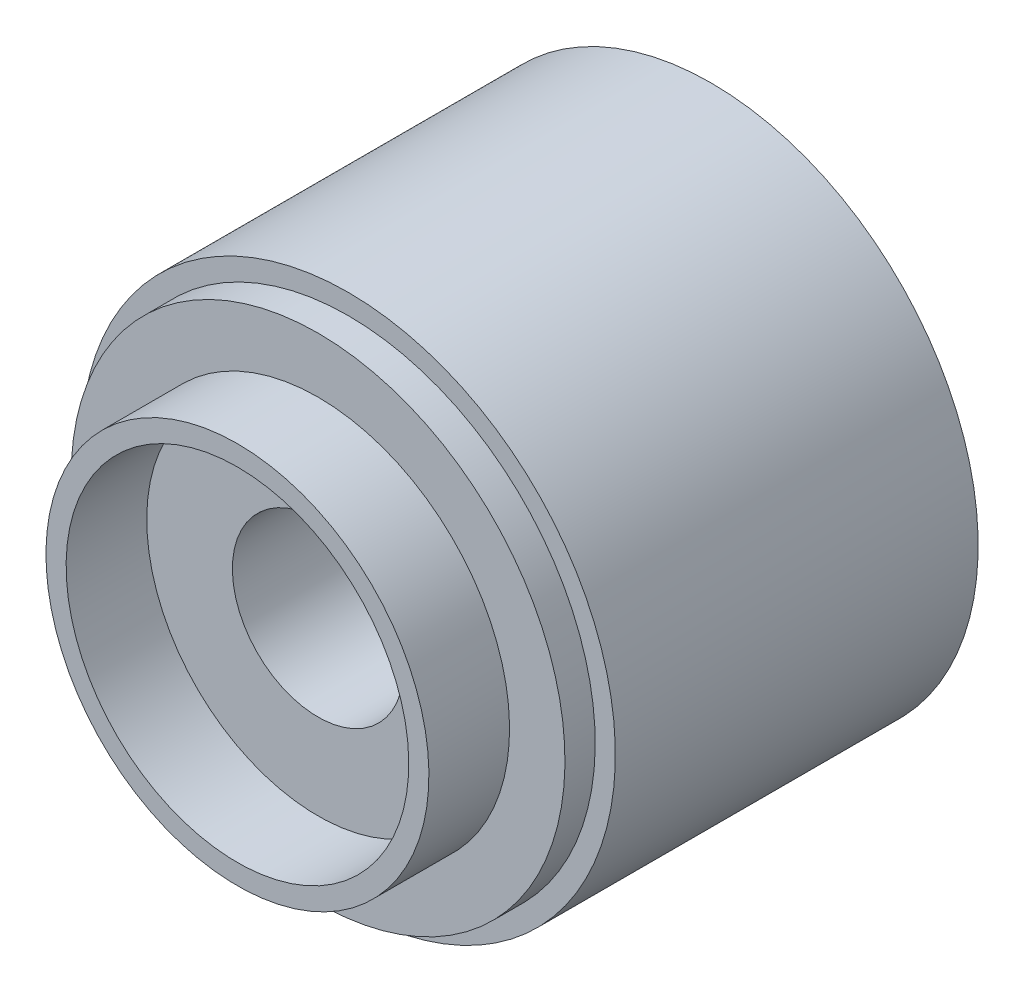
ISO-10303-21;
HEADER;
FILE_DESCRIPTION(('STEP AP214'),'2;1');
FILE_NAME('part.step','',(''),(''),'','','');
FILE_SCHEMA(('AUTOMOTIVE_DESIGN { 1 0 10303 214 1 1 1 1 }'));
ENDSEC;
DATA;
#1=APPLICATION_CONTEXT('core data for automotive mechanical design processes');
#2=APPLICATION_PROTOCOL_DEFINITION('international standard','automotive_design',2000,#1);
#3=PRODUCT_CONTEXT('',#1,'mechanical');
#4=PRODUCT('Part','Part','',(#3));
#5=PRODUCT_RELATED_PRODUCT_CATEGORY('part','',(#4));
#6=PRODUCT_DEFINITION_FORMATION('','',#4);
#7=PRODUCT_DEFINITION_CONTEXT('part definition',#1,'design');
#8=PRODUCT_DEFINITION('design','',#6,#7);
#9=PRODUCT_DEFINITION_SHAPE('','',#8);
#10=(LENGTH_UNIT() NAMED_UNIT(*) SI_UNIT(.MILLI.,.METRE.));
#11=(NAMED_UNIT(*) PLANE_ANGLE_UNIT() SI_UNIT($,.RADIAN.));
#12=(NAMED_UNIT(*) SI_UNIT($,.STERADIAN.) SOLID_ANGLE_UNIT());
#13=UNCERTAINTY_MEASURE_WITH_UNIT(LENGTH_MEASURE(1.E-05),#10,'distance_accuracy_value','');
#14=(GEOMETRIC_REPRESENTATION_CONTEXT(3) GLOBAL_UNCERTAINTY_ASSIGNED_CONTEXT((#13)) GLOBAL_UNIT_ASSIGNED_CONTEXT((#10,
#11,#12)) REPRESENTATION_CONTEXT('',''));
#15=CARTESIAN_POINT('',(0.,0.,0.));
#16=DIRECTION('',(0.,0.,1.));
#17=DIRECTION('',(1.,0.,0.));
#18=AXIS2_PLACEMENT_3D('',#15,#16,#17);
#19=CARTESIAN_POINT('',(0.,0.,-4.42931997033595));
#20=DIRECTION('',(0.,0.,-1.));
#21=DIRECTION('',(0.,1.,0.));
#22=AXIS2_PLACEMENT_3D('',#19,#20,#21);
#23=CYLINDRICAL_SURFACE('',#22,4.25);
#24=CARTESIAN_POINT('',(0.,0.,0.));
#25=DIRECTION('',(0.,0.,-1.));
#26=DIRECTION('',(0.,1.,0.));
#27=AXIS2_PLACEMENT_3D('',#24,#25,#26);
#28=CIRCLE('',#27,4.25);
#29=CARTESIAN_POINT('',(0.,4.25,0.));
#30=VERTEX_POINT('',#29);
#31=EDGE_CURVE('E8',#30,#30,#28,.T.);
#32=ORIENTED_EDGE('',*,*,#31,.T.);
#33=EDGE_LOOP('',(#32));
#34=FACE_BOUND('',#33,.T.);
#35=CARTESIAN_POINT('',(0.,0.,19.5));
#36=DIRECTION('',(0.,0.,-1.));
#37=DIRECTION('',(0.,1.,0.));
#38=AXIS2_PLACEMENT_3D('',#35,#36,#37);
#39=CIRCLE('',#38,4.25);
#40=CARTESIAN_POINT('',(0.,4.25,19.5));
#41=VERTEX_POINT('',#40);
#42=EDGE_CURVE('E46',#41,#41,#39,.T.);
#43=ORIENTED_EDGE('',*,*,#42,.F.);
#44=EDGE_LOOP('',(#43));
#45=FACE_BOUND('',#44,.T.);
#46=ADVANCED_FACE('F12',(#34,#45),#23,.F.);
#47=CARTESIAN_POINT('',(4.25,0.,0.));
#48=DIRECTION('',(0.,0.,-1.));
#49=DIRECTION('',(0.,1.,0.));
#50=AXIS2_PLACEMENT_3D('',#47,#48,#49);
#51=PLANE('',#50);
#52=CARTESIAN_POINT('',(0.,0.,0.));
#53=DIRECTION('',(0.,0.,-1.));
#54=DIRECTION('',(0.,1.,0.));
#55=AXIS2_PLACEMENT_3D('',#52,#53,#54);
#56=CIRCLE('',#55,13.25);
#57=CARTESIAN_POINT('',(0.,13.25,0.));
#58=VERTEX_POINT('',#57);
#59=EDGE_CURVE('E18',#58,#58,#56,.T.);
#60=ORIENTED_EDGE('',*,*,#59,.T.);
#61=EDGE_LOOP('',(#60));
#62=FACE_BOUND('',#61,.T.);
#63=ORIENTED_EDGE('',*,*,#31,.F.);
#64=EDGE_LOOP('',(#63));
#65=FACE_BOUND('',#64,.T.);
#66=ADVANCED_FACE('F54',(#62,#65),#51,.T.);
#67=CARTESIAN_POINT('',(0.,0.,-4.42931997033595));
#68=DIRECTION('',(0.,0.,-1.));
#69=DIRECTION('',(0.,1.,0.));
#70=AXIS2_PLACEMENT_3D('',#67,#68,#69);
#71=CYLINDRICAL_SURFACE('',#70,13.25);
#72=CARTESIAN_POINT('',(0.,0.,18.));
#73=DIRECTION('',(0.,0.,-1.));
#74=DIRECTION('',(0.,1.,0.));
#75=AXIS2_PLACEMENT_3D('',#72,#73,#74);
#76=CIRCLE('',#75,13.25);
#77=CARTESIAN_POINT('',(0.,13.25,18.));
#78=VERTEX_POINT('',#77);
#79=EDGE_CURVE('E22',#78,#78,#76,.T.);
#80=ORIENTED_EDGE('',*,*,#79,.T.);
#81=EDGE_LOOP('',(#80));
#82=FACE_BOUND('',#81,.T.);
#83=ORIENTED_EDGE('',*,*,#59,.F.);
#84=EDGE_LOOP('',(#83));
#85=FACE_BOUND('',#84,.T.);
#86=ADVANCED_FACE('F60',(#82,#85),#71,.T.);
#87=CARTESIAN_POINT('',(13.25,0.,18.));
#88=DIRECTION('',(0.,0.,1.));
#89=DIRECTION('',(0.,-1.,0.));
#90=AXIS2_PLACEMENT_3D('',#87,#88,#89);
#91=PLANE('',#90);
#92=CARTESIAN_POINT('',(0.,0.,18.));
#93=DIRECTION('',(0.,0.,-1.));
#94=DIRECTION('',(0.,1.,0.));
#95=AXIS2_PLACEMENT_3D('',#92,#93,#94);
#96=CIRCLE('',#95,12.25);
#97=CARTESIAN_POINT('',(0.,12.25,18.));
#98=VERTEX_POINT('',#97);
#99=EDGE_CURVE('E26',#98,#98,#96,.T.);
#100=ORIENTED_EDGE('',*,*,#99,.T.);
#101=EDGE_LOOP('',(#100));
#102=FACE_BOUND('',#101,.T.);
#103=ORIENTED_EDGE('',*,*,#79,.F.);
#104=EDGE_LOOP('',(#103));
#105=FACE_BOUND('',#104,.T.);
#106=ADVANCED_FACE('F65',(#102,#105),#91,.T.);
#107=CARTESIAN_POINT('',(0.,0.,-4.42931997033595));
#108=DIRECTION('',(0.,0.,-1.));
#109=DIRECTION('',(0.,1.,0.));
#110=AXIS2_PLACEMENT_3D('',#107,#108,#109);
#111=CYLINDRICAL_SURFACE('',#110,12.25);
#112=CARTESIAN_POINT('',(0.,0.,19.5));
#113=DIRECTION('',(0.,0.,-1.));
#114=DIRECTION('',(0.,1.,0.));
#115=AXIS2_PLACEMENT_3D('',#112,#113,#114);
#116=CIRCLE('',#115,12.25);
#117=CARTESIAN_POINT('',(0.,12.25,19.5));
#118=VERTEX_POINT('',#117);
#119=EDGE_CURVE('E31',#118,#118,#116,.T.);
#120=ORIENTED_EDGE('',*,*,#119,.T.);
#121=EDGE_LOOP('',(#120));
#122=FACE_BOUND('',#121,.T.);
#123=ORIENTED_EDGE('',*,*,#99,.F.);
#124=EDGE_LOOP('',(#123));
#125=FACE_BOUND('',#124,.T.);
#126=ADVANCED_FACE('F72',(#122,#125),#111,.T.);
#127=CARTESIAN_POINT('',(12.25,0.,19.5));
#128=DIRECTION('',(0.,0.,1.));
#129=DIRECTION('',(0.,-1.,0.));
#130=AXIS2_PLACEMENT_3D('',#127,#128,#129);
#131=PLANE('',#130);
#132=CARTESIAN_POINT('',(0.,0.,19.5));
#133=DIRECTION('',(0.,0.,-1.));
#134=DIRECTION('',(0.,1.,0.));
#135=AXIS2_PLACEMENT_3D('',#132,#133,#134);
#136=CIRCLE('',#135,9.5);
#137=CARTESIAN_POINT('',(0.,9.5,19.5));
#138=VERTEX_POINT('',#137);
#139=EDGE_CURVE('E34',#138,#138,#136,.T.);
#140=ORIENTED_EDGE('',*,*,#139,.T.);
#141=EDGE_LOOP('',(#140));
#142=FACE_BOUND('',#141,.T.);
#143=ORIENTED_EDGE('',*,*,#119,.F.);
#144=EDGE_LOOP('',(#143));
#145=FACE_BOUND('',#144,.T.);
#146=ADVANCED_FACE('F76',(#142,#145),#131,.T.);
#147=CARTESIAN_POINT('',(0.,0.,-4.42931997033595));
#148=DIRECTION('',(0.,0.,-1.));
#149=DIRECTION('',(0.,1.,0.));
#150=AXIS2_PLACEMENT_3D('',#147,#148,#149);
#151=CYLINDRICAL_SURFACE('',#150,9.5);
#152=CARTESIAN_POINT('',(0.,0.,23.5));
#153=DIRECTION('',(0.,0.,-1.));
#154=DIRECTION('',(0.,1.,0.));
#155=AXIS2_PLACEMENT_3D('',#152,#153,#154);
#156=CIRCLE('',#155,9.5);
#157=CARTESIAN_POINT('',(0.,9.5,23.5));
#158=VERTEX_POINT('',#157);
#159=EDGE_CURVE('E37',#158,#158,#156,.T.);
#160=ORIENTED_EDGE('',*,*,#159,.T.);
#161=EDGE_LOOP('',(#160));
#162=FACE_BOUND('',#161,.T.);
#163=ORIENTED_EDGE('',*,*,#139,.F.);
#164=EDGE_LOOP('',(#163));
#165=FACE_BOUND('',#164,.T.);
#166=ADVANCED_FACE('F80',(#162,#165),#151,.T.);
#167=CARTESIAN_POINT('',(9.5,0.,23.5));
#168=DIRECTION('',(0.,0.,1.));
#169=DIRECTION('',(0.,-1.,0.));
#170=AXIS2_PLACEMENT_3D('',#167,#168,#169);
#171=PLANE('',#170);
#172=CARTESIAN_POINT('',(0.,0.,23.5));
#173=DIRECTION('',(0.,0.,-1.));
#174=DIRECTION('',(0.,1.,0.));
#175=AXIS2_PLACEMENT_3D('',#172,#173,#174);
#176=CIRCLE('',#175,8.5);
#177=CARTESIAN_POINT('',(0.,8.5,23.5));
#178=VERTEX_POINT('',#177);
#179=EDGE_CURVE('E40',#178,#178,#176,.T.);
#180=ORIENTED_EDGE('',*,*,#179,.T.);
#181=EDGE_LOOP('',(#180));
#182=FACE_BOUND('',#181,.T.);
#183=ORIENTED_EDGE('',*,*,#159,.F.);
#184=EDGE_LOOP('',(#183));
#185=FACE_BOUND('',#184,.T.);
#186=ADVANCED_FACE('F84',(#182,#185),#171,.T.);
#187=CARTESIAN_POINT('',(0.,0.,-4.42931997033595));
#188=DIRECTION('',(0.,0.,-1.));
#189=DIRECTION('',(0.,1.,0.));
#190=AXIS2_PLACEMENT_3D('',#187,#188,#189);
#191=CYLINDRICAL_SURFACE('',#190,8.5);
#192=CARTESIAN_POINT('',(0.,0.,19.5));
#193=DIRECTION('',(0.,0.,-1.));
#194=DIRECTION('',(0.,1.,0.));
#195=AXIS2_PLACEMENT_3D('',#192,#193,#194);
#196=CIRCLE('',#195,8.5);
#197=CARTESIAN_POINT('',(0.,8.5,19.5));
#198=VERTEX_POINT('',#197);
#199=EDGE_CURVE('E43',#198,#198,#196,.T.);
#200=ORIENTED_EDGE('',*,*,#199,.T.);
#201=EDGE_LOOP('',(#200));
#202=FACE_BOUND('',#201,.T.);
#203=ORIENTED_EDGE('',*,*,#179,.F.);
#204=EDGE_LOOP('',(#203));
#205=FACE_BOUND('',#204,.T.);
#206=ADVANCED_FACE('F88',(#202,#205),#191,.F.);
#207=CARTESIAN_POINT('',(8.5,0.,19.5));
#208=DIRECTION('',(0.,0.,1.));
#209=DIRECTION('',(0.,-1.,0.));
#210=AXIS2_PLACEMENT_3D('',#207,#208,#209);
#211=PLANE('',#210);
#212=ORIENTED_EDGE('',*,*,#42,.T.);
#213=EDGE_LOOP('',(#212));
#214=FACE_BOUND('',#213,.T.);
#215=ORIENTED_EDGE('',*,*,#199,.F.);
#216=EDGE_LOOP('',(#215));
#217=FACE_BOUND('',#216,.T.);
#218=ADVANCED_FACE('F50',(#214,#217),#211,.T.);
#219=CLOSED_SHELL('',(#46,#66,#86,#106,#126,#146,#166,#186,#206,#218));
#220=MANIFOLD_SOLID_BREP('B1',#219);
#221=ADVANCED_BREP_SHAPE_REPRESENTATION('',(#18,#220),#14);
#222=SHAPE_DEFINITION_REPRESENTATION(#9,#221);
ENDSEC;
END-ISO-10303-21;
